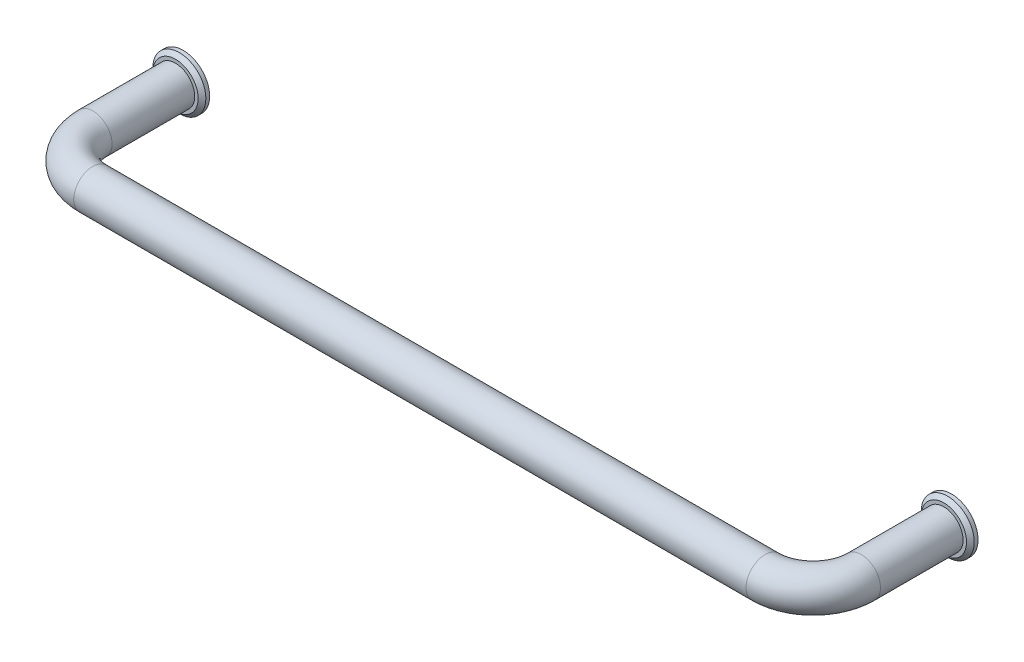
ISO-10303-21;
HEADER;
FILE_DESCRIPTION(('STEP AP214'),'2;1');
FILE_NAME('part.step','',(''),(''),'','','');
FILE_SCHEMA(('AUTOMOTIVE_DESIGN { 1 0 10303 214 1 1 1 1 }'));
ENDSEC;
DATA;
#1=APPLICATION_CONTEXT('core data for automotive mechanical design processes');
#2=APPLICATION_PROTOCOL_DEFINITION('international standard','automotive_design',2000,#1);
#3=PRODUCT_CONTEXT('',#1,'mechanical');
#4=PRODUCT('Part','Part','',(#3));
#5=PRODUCT_RELATED_PRODUCT_CATEGORY('part','',(#4));
#6=PRODUCT_DEFINITION_FORMATION('','',#4);
#7=PRODUCT_DEFINITION_CONTEXT('part definition',#1,'design');
#8=PRODUCT_DEFINITION('design','',#6,#7);
#9=PRODUCT_DEFINITION_SHAPE('','',#8);
#10=(LENGTH_UNIT() NAMED_UNIT(*) SI_UNIT(.MILLI.,.METRE.));
#11=(NAMED_UNIT(*) PLANE_ANGLE_UNIT() SI_UNIT($,.RADIAN.));
#12=(NAMED_UNIT(*) SI_UNIT($,.STERADIAN.) SOLID_ANGLE_UNIT());
#13=UNCERTAINTY_MEASURE_WITH_UNIT(LENGTH_MEASURE(1.E-05),#10,'distance_accuracy_value','');
#14=(GEOMETRIC_REPRESENTATION_CONTEXT(3) GLOBAL_UNCERTAINTY_ASSIGNED_CONTEXT((#13)) GLOBAL_UNIT_ASSIGNED_CONTEXT((#10,
#11,#12)) REPRESENTATION_CONTEXT('',''));
#15=CARTESIAN_POINT('',(0.,0.,0.));
#16=DIRECTION('',(0.,0.,1.));
#17=DIRECTION('',(1.,0.,0.));
#18=AXIS2_PLACEMENT_3D('',#15,#16,#17);
#19=CARTESIAN_POINT('',(0.,0.,0.));
#20=DIRECTION('',(0.,0.,1.));
#21=DIRECTION('',(0.,1.,0.));
#22=AXIS2_PLACEMENT_3D('',#19,#20,#21);
#23=PLANE('',#22);
#24=CARTESIAN_POINT('',(0.,0.,0.));
#25=DIRECTION('',(0.,0.,1.));
#26=DIRECTION('',(1.,0.,0.));
#27=AXIS2_PLACEMENT_3D('',#24,#25,#26);
#28=CIRCLE('',#27,6.9);
#29=CARTESIAN_POINT('',(6.9,0.,0.));
#30=VERTEX_POINT('',#29);
#31=EDGE_CURVE('E30',#30,#30,#28,.T.);
#32=ORIENTED_EDGE('',*,*,#31,.F.);
#33=EDGE_LOOP('',(#32));
#34=FACE_BOUND('',#33,.T.);
#35=CARTESIAN_POINT('',(0.,0.,0.));
#36=DIRECTION('',(0.,0.,1.));
#37=DIRECTION('',(0.,1.,0.));
#38=AXIS2_PLACEMENT_3D('',#35,#36,#37);
#39=CIRCLE('',#38,2.5);
#40=CARTESIAN_POINT('',(0.,2.5,0.));
#41=VERTEX_POINT('',#40);
#42=EDGE_CURVE('E16',#41,#41,#39,.F.);
#43=ORIENTED_EDGE('',*,*,#42,.F.);
#44=EDGE_LOOP('',(#43));
#45=FACE_BOUND('',#44,.T.);
#46=ADVANCED_FACE('F12',(#34,#45),#23,.F.);
#47=CARTESIAN_POINT('',(0.,0.,23.5));
#48=DIRECTION('',(0.,0.,-1.));
#49=DIRECTION('',(-1.,0.,0.));
#50=AXIS2_PLACEMENT_3D('',#47,#48,#49);
#51=CYLINDRICAL_SURFACE('',#50,5.);
#52=CARTESIAN_POINT('',(0.,0.,23.5));
#53=DIRECTION('',(0.,0.,1.));
#54=DIRECTION('',(0.,1.,0.));
#55=AXIS2_PLACEMENT_3D('',#52,#53,#54);
#56=CIRCLE('',#55,5.);
#57=CARTESIAN_POINT('',(-5.,0.,23.5));
#58=VERTEX_POINT('',#57);
#59=EDGE_CURVE('E51',#58,#58,#56,.T.);
#60=ORIENTED_EDGE('',*,*,#59,.F.);
#61=EDGE_LOOP('',(#60));
#62=FACE_BOUND('',#61,.T.);
#63=CARTESIAN_POINT('',(0.,0.,2.00000000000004));
#64=DIRECTION('',(0.,0.,-1.));
#65=DIRECTION('',(-1.,0.,0.));
#66=AXIS2_PLACEMENT_3D('',#63,#64,#65);
#67=CIRCLE('',#66,5.);
#68=CARTESIAN_POINT('',(-5.,0.,2.00000000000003));
#69=VERTEX_POINT('',#68);
#70=EDGE_CURVE('E25',#69,#69,#67,.T.);
#71=ORIENTED_EDGE('',*,*,#70,.F.);
#72=EDGE_LOOP('',(#71));
#73=FACE_BOUND('',#72,.T.);
#74=ADVANCED_FACE('F75',(#62,#73),#51,.T.);
#75=CARTESIAN_POINT('',(200.,0.,23.5));
#76=DIRECTION('',(0.,0.,-1.));
#77=DIRECTION('',(-1.,0.,0.));
#78=AXIS2_PLACEMENT_3D('',#75,#76,#77);
#79=CYLINDRICAL_SURFACE('',#78,5.);
#80=CARTESIAN_POINT('',(200.,0.,23.5));
#81=DIRECTION('',(0.,0.,-1.));
#82=DIRECTION('',(0.,1.,0.));
#83=AXIS2_PLACEMENT_3D('',#80,#81,#82);
#84=CIRCLE('',#83,5.);
#85=CARTESIAN_POINT('',(205.,0.,23.5));
#86=VERTEX_POINT('',#85);
#87=EDGE_CURVE('E60',#86,#86,#84,.T.);
#88=ORIENTED_EDGE('',*,*,#87,.T.);
#89=EDGE_LOOP('',(#88));
#90=FACE_BOUND('',#89,.T.);
#91=CARTESIAN_POINT('',(200.,0.,2.00000000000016));
#92=DIRECTION('',(0.,0.,-1.));
#93=DIRECTION('',(-1.,0.,0.));
#94=AXIS2_PLACEMENT_3D('',#91,#92,#93);
#95=CIRCLE('',#94,5.);
#96=CARTESIAN_POINT('',(195.,0.,2.00000000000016));
#97=VERTEX_POINT('',#96);
#98=EDGE_CURVE('E50',#97,#97,#95,.F.);
#99=ORIENTED_EDGE('',*,*,#98,.T.);
#100=EDGE_LOOP('',(#99));
#101=FACE_BOUND('',#100,.T.);
#102=ADVANCED_FACE('F14',(#90,#101),#79,.T.);
#103=CARTESIAN_POINT('',(187.5,0.,23.5));
#104=DIRECTION('',(0.,1.,0.));
#105=DIRECTION('',(-1.,0.,0.));
#106=AXIS2_PLACEMENT_3D('',#103,#104,#105);
#107=TOROIDAL_SURFACE('',#106,12.5,5.);
#108=CARTESIAN_POINT('',(187.5,0.,36.));
#109=DIRECTION('',(1.,0.,0.));
#110=DIRECTION('',(0.,1.,0.));
#111=AXIS2_PLACEMENT_3D('',#108,#109,#110);
#112=CIRCLE('',#111,5.);
#113=CARTESIAN_POINT('',(187.5,0.,41.));
#114=VERTEX_POINT('',#113);
#115=EDGE_CURVE('E57',#114,#114,#112,.T.);
#116=CARTESIAN_POINT('',(187.5,0.,23.5));
#117=DIRECTION('',(0.,1.,0.));
#118=DIRECTION('',(-1.,0.,0.));
#119=AXIS2_PLACEMENT_3D('',#116,#117,#118);
#120=CIRCLE('',#119,17.5);
#121=EDGE_CURVE('',#114,#86,#120,.T.);
#122=ORIENTED_EDGE('',*,*,#115,.T.);
#123=ORIENTED_EDGE('',*,*,#87,.F.);
#124=ORIENTED_EDGE('',*,*,#121,.T.);
#125=ORIENTED_EDGE('',*,*,#121,.F.);
#126=EDGE_LOOP('',(#122,#124,#123,#125));
#127=FACE_BOUND('',#126,.T.);
#128=ADVANCED_FACE('F85',(#127),#107,.T.);
#129=CARTESIAN_POINT('',(12.5,0.,36.));
#130=DIRECTION('',(1.,0.,0.));
#131=DIRECTION('',(0.,0.,-1.));
#132=AXIS2_PLACEMENT_3D('',#129,#130,#131);
#133=CYLINDRICAL_SURFACE('',#132,5.);
#134=CARTESIAN_POINT('',(12.5,0.,36.));
#135=DIRECTION('',(1.,0.,0.));
#136=DIRECTION('',(0.,1.,0.));
#137=AXIS2_PLACEMENT_3D('',#134,#135,#136);
#138=CIRCLE('',#137,5.);
#139=CARTESIAN_POINT('',(12.5,0.,41.));
#140=VERTEX_POINT('',#139);
#141=EDGE_CURVE('E54',#140,#140,#138,.T.);
#142=ORIENTED_EDGE('',*,*,#141,.T.);
#143=EDGE_LOOP('',(#142));
#144=FACE_BOUND('',#143,.T.);
#145=ORIENTED_EDGE('',*,*,#115,.F.);
#146=EDGE_LOOP('',(#145));
#147=FACE_BOUND('',#146,.T.);
#148=ADVANCED_FACE('F97',(#144,#147),#133,.T.);
#149=CARTESIAN_POINT('',(12.5,0.,23.5));
#150=DIRECTION('',(0.,1.,0.));
#151=DIRECTION('',(-1.,0.,0.));
#152=AXIS2_PLACEMENT_3D('',#149,#150,#151);
#153=TOROIDAL_SURFACE('',#152,12.5,5.);
#154=CARTESIAN_POINT('',(12.5,0.,23.5));
#155=DIRECTION('',(0.,1.,0.));
#156=DIRECTION('',(-1.,0.,0.));
#157=AXIS2_PLACEMENT_3D('',#154,#155,#156);
#158=CIRCLE('',#157,17.5);
#159=EDGE_CURVE('',#58,#140,#158,.T.);
#160=ORIENTED_EDGE('',*,*,#59,.T.);
#161=ORIENTED_EDGE('',*,*,#141,.F.);
#162=ORIENTED_EDGE('',*,*,#159,.T.);
#163=ORIENTED_EDGE('',*,*,#159,.F.);
#164=EDGE_LOOP('',(#160,#162,#161,#163));
#165=FACE_BOUND('',#164,.T.);
#166=ADVANCED_FACE('F93',(#165),#153,.T.);
#167=CARTESIAN_POINT('',(200.,0.,2.00000000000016));
#168=DIRECTION('',(0.,0.,-1.));
#169=DIRECTION('',(-1.,0.,0.));
#170=AXIS2_PLACEMENT_3D('',#167,#168,#169);
#171=CYLINDRICAL_SURFACE('',#170,6.9);
#172=CARTESIAN_POINT('',(200.,0.,1.00000000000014));
#173=DIRECTION('',(0.,0.,-1.));
#174=DIRECTION('',(0.,-1.,0.));
#175=AXIS2_PLACEMENT_3D('',#172,#173,#174);
#176=CIRCLE('',#175,6.9);
#177=CARTESIAN_POINT('',(200.,-6.9,1.00000000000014));
#178=VERTEX_POINT('',#177);
#179=EDGE_CURVE('E63',#178,#178,#176,.T.);
#180=ORIENTED_EDGE('',*,*,#179,.T.);
#181=EDGE_LOOP('',(#180));
#182=FACE_BOUND('',#181,.T.);
#183=CARTESIAN_POINT('',(200.,0.,1.63546224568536E-13));
#184=DIRECTION('',(0.,0.,-1.));
#185=DIRECTION('',(-1.,0.,0.));
#186=AXIS2_PLACEMENT_3D('',#183,#184,#185);
#187=CIRCLE('',#186,6.9);
#188=CARTESIAN_POINT('',(193.1,0.,1.56715336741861E-13));
#189=VERTEX_POINT('',#188);
#190=EDGE_CURVE('E34',#189,#189,#187,.T.);
#191=ORIENTED_EDGE('',*,*,#190,.F.);
#192=EDGE_LOOP('',(#191));
#193=FACE_BOUND('',#192,.T.);
#194=ADVANCED_FACE('F96',(#182,#193),#171,.T.);
#195=CARTESIAN_POINT('',(200.,0.,2.00000000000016));
#196=DIRECTION('',(0.,0.,-1.));
#197=DIRECTION('',(-1.,0.,0.));
#198=AXIS2_PLACEMENT_3D('',#195,#196,#197);
#199=PLANE('',#198);
#200=CARTESIAN_POINT('',(200.,0.,2.00000000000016));
#201=DIRECTION('',(0.,0.,-1.));
#202=DIRECTION('',(-1.,0.,0.));
#203=AXIS2_PLACEMENT_3D('',#200,#201,#202);
#204=CIRCLE('',#203,5.9);
#205=CARTESIAN_POINT('',(194.1,0.,2.00000000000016));
#206=VERTEX_POINT('',#205);
#207=EDGE_CURVE('E68',#206,#206,#204,.F.);
#208=ORIENTED_EDGE('',*,*,#207,.T.);
#209=EDGE_LOOP('',(#208));
#210=FACE_BOUND('',#209,.T.);
#211=ORIENTED_EDGE('',*,*,#98,.F.);
#212=EDGE_LOOP('',(#211));
#213=FACE_BOUND('',#212,.T.);
#214=ADVANCED_FACE('F112',(#210,#213),#199,.F.);
#215=CARTESIAN_POINT('',(200.,0.,1.53381829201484E-13));
#216=DIRECTION('',(0.,0.,-1.));
#217=DIRECTION('',(0.,1.,0.));
#218=AXIS2_PLACEMENT_3D('',#215,#216,#217);
#219=PLANE('',#218);
#220=CARTESIAN_POINT('',(200.,0.,1.53381829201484E-13));
#221=DIRECTION('',(0.,0.,-1.));
#222=DIRECTION('',(-1.,0.,0.));
#223=AXIS2_PLACEMENT_3D('',#220,#221,#222);
#224=CIRCLE('',#223,2.5);
#225=CARTESIAN_POINT('',(197.5,0.,1.50906869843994E-13));
#226=VERTEX_POINT('',#225);
#227=EDGE_CURVE('E28',#226,#226,#224,.T.);
#228=ORIENTED_EDGE('',*,*,#227,.F.);
#229=EDGE_LOOP('',(#228));
#230=FACE_BOUND('',#229,.T.);
#231=ORIENTED_EDGE('',*,*,#190,.T.);
#232=EDGE_LOOP('',(#231));
#233=FACE_BOUND('',#232,.T.);
#234=ADVANCED_FACE('F92',(#230,#233),#219,.T.);
#235=CARTESIAN_POINT('',(200.,0.,1.00000000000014));
#236=DIRECTION('',(0.,0.,-1.));
#237=DIRECTION('',(0.,-1.,0.));
#238=AXIS2_PLACEMENT_3D('',#235,#236,#237);
#239=CONICAL_SURFACE('',#238,6.9,0.785398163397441);
#240=ORIENTED_EDGE('',*,*,#207,.F.);
#241=EDGE_LOOP('',(#240));
#242=FACE_BOUND('',#241,.T.);
#243=ORIENTED_EDGE('',*,*,#179,.F.);
#244=EDGE_LOOP('',(#243));
#245=FACE_BOUND('',#244,.T.);
#246=ADVANCED_FACE('F121',(#242,#245),#239,.T.);
#247=CARTESIAN_POINT('',(0.,0.,2.00000000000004));
#248=DIRECTION('',(0.,0.,-1.));
#249=DIRECTION('',(1.,0.,0.));
#250=AXIS2_PLACEMENT_3D('',#247,#248,#249);
#251=PLANE('',#250);
#252=CARTESIAN_POINT('',(0.,0.,2.00000000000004));
#253=DIRECTION('',(0.,0.,-1.));
#254=DIRECTION('',(-1.,0.,0.));
#255=AXIS2_PLACEMENT_3D('',#252,#253,#254);
#256=CIRCLE('',#255,5.9);
#257=CARTESIAN_POINT('',(-5.9,0.,2.00000000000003));
#258=VERTEX_POINT('',#257);
#259=EDGE_CURVE('E20',#258,#258,#256,.F.);
#260=ORIENTED_EDGE('',*,*,#259,.T.);
#261=EDGE_LOOP('',(#260));
#262=FACE_BOUND('',#261,.T.);
#263=ORIENTED_EDGE('',*,*,#70,.T.);
#264=EDGE_LOOP('',(#263));
#265=FACE_BOUND('',#264,.T.);
#266=ADVANCED_FACE('F73',(#262,#265),#251,.F.);
#267=CARTESIAN_POINT('',(0.,0.,2.00000000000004));
#268=DIRECTION('',(0.,0.,-1.));
#269=DIRECTION('',(-1.,0.,0.));
#270=AXIS2_PLACEMENT_3D('',#267,#268,#269);
#271=CYLINDRICAL_SURFACE('',#270,6.9);
#272=CARTESIAN_POINT('',(0.,0.,1.00000000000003));
#273=DIRECTION('',(0.,0.,-1.));
#274=DIRECTION('',(0.,-1.,0.));
#275=AXIS2_PLACEMENT_3D('',#272,#273,#274);
#276=CIRCLE('',#275,6.9);
#277=CARTESIAN_POINT('',(0.,-6.9,1.00000000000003));
#278=VERTEX_POINT('',#277);
#279=EDGE_CURVE('E8',#278,#278,#276,.T.);
#280=ORIENTED_EDGE('',*,*,#279,.T.);
#281=EDGE_LOOP('',(#280));
#282=FACE_BOUND('',#281,.T.);
#283=ORIENTED_EDGE('',*,*,#31,.T.);
#284=EDGE_LOOP('',(#283));
#285=FACE_BOUND('',#284,.T.);
#286=ADVANCED_FACE('F129',(#282,#285),#271,.T.);
#287=CARTESIAN_POINT('',(0.,0.,2.00000000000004));
#288=DIRECTION('',(0.,0.,-1.));
#289=DIRECTION('',(0.,-1.,0.));
#290=AXIS2_PLACEMENT_3D('',#287,#288,#289);
#291=CONICAL_SURFACE('',#290,5.9,0.785398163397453);
#292=ORIENTED_EDGE('',*,*,#279,.F.);
#293=EDGE_LOOP('',(#292));
#294=FACE_BOUND('',#293,.T.);
#295=ORIENTED_EDGE('',*,*,#259,.F.);
#296=EDGE_LOOP('',(#295));
#297=FACE_BOUND('',#296,.T.);
#298=ADVANCED_FACE('F132',(#294,#297),#291,.T.);
#299=CARTESIAN_POINT('',(200.,0.,-7.99999999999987));
#300=DIRECTION('',(0.,0.,1.));
#301=DIRECTION('',(1.,0.,0.));
#302=AXIS2_PLACEMENT_3D('',#299,#300,#301);
#303=CYLINDRICAL_SURFACE('',#302,2.5);
#304=ORIENTED_EDGE('',*,*,#227,.T.);
#305=EDGE_LOOP('',(#304));
#306=FACE_BOUND('',#305,.T.);
#307=CARTESIAN_POINT('',(200.,0.,11.0000000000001));
#308=DIRECTION('',(0.,0.,-1.));
#309=DIRECTION('',(-1.,0.,0.));
#310=AXIS2_PLACEMENT_3D('',#307,#308,#309);
#311=CIRCLE('',#310,2.5);
#312=CARTESIAN_POINT('',(197.5,0.,11.0000000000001));
#313=VERTEX_POINT('',#312);
#314=EDGE_CURVE('E41',#313,#313,#311,.T.);
#315=ORIENTED_EDGE('',*,*,#314,.F.);
#316=EDGE_LOOP('',(#315));
#317=FACE_BOUND('',#316,.T.);
#318=ADVANCED_FACE('F138',(#306,#317),#303,.F.);
#319=CARTESIAN_POINT('',(0.,0.,-8.));
#320=DIRECTION('',(0.,0.,1.));
#321=DIRECTION('',(1.,0.,0.));
#322=AXIS2_PLACEMENT_3D('',#319,#320,#321);
#323=CYLINDRICAL_SURFACE('',#322,2.5);
#324=ORIENTED_EDGE('',*,*,#42,.T.);
#325=EDGE_LOOP('',(#324));
#326=FACE_BOUND('',#325,.T.);
#327=CARTESIAN_POINT('',(0.,0.,11.));
#328=DIRECTION('',(0.,0.,-1.));
#329=DIRECTION('',(-1.,0.,0.));
#330=AXIS2_PLACEMENT_3D('',#327,#328,#329);
#331=CIRCLE('',#330,2.5);
#332=CARTESIAN_POINT('',(-2.50000000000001,0.,11.));
#333=VERTEX_POINT('',#332);
#334=EDGE_CURVE('E37',#333,#333,#331,.T.);
#335=ORIENTED_EDGE('',*,*,#334,.F.);
#336=EDGE_LOOP('',(#335));
#337=FACE_BOUND('',#336,.T.);
#338=ADVANCED_FACE('F142',(#326,#337),#323,.F.);
#339=CARTESIAN_POINT('',(0.,0.,11.));
#340=DIRECTION('',(0.,0.,-1.));
#341=DIRECTION('',(-1.,0.,0.));
#342=AXIS2_PLACEMENT_3D('',#339,#340,#341);
#343=PLANE('',#342);
#344=ORIENTED_EDGE('',*,*,#334,.T.);
#345=EDGE_LOOP('',(#344));
#346=FACE_BOUND('',#345,.T.);
#347=ADVANCED_FACE('F145',(#346),#343,.T.);
#348=CARTESIAN_POINT('',(200.,0.,11.0000000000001));
#349=DIRECTION('',(0.,0.,-1.));
#350=DIRECTION('',(-1.,0.,0.));
#351=AXIS2_PLACEMENT_3D('',#348,#349,#350);
#352=PLANE('',#351);
#353=ORIENTED_EDGE('',*,*,#314,.T.);
#354=EDGE_LOOP('',(#353));
#355=FACE_BOUND('',#354,.T.);
#356=ADVANCED_FACE('F148',(#355),#352,.T.);
#357=CLOSED_SHELL('',(#46,#74,#102,#128,#148,#166,#194,#214,#234,#246,#266,#286,#298,#318,#338,
#347,#356));
#358=MANIFOLD_SOLID_BREP('B1',#357);
#359=ADVANCED_BREP_SHAPE_REPRESENTATION('',(#18,#358),#14);
#360=SHAPE_DEFINITION_REPRESENTATION(#9,#359);
ENDSEC;
END-ISO-10303-21;
